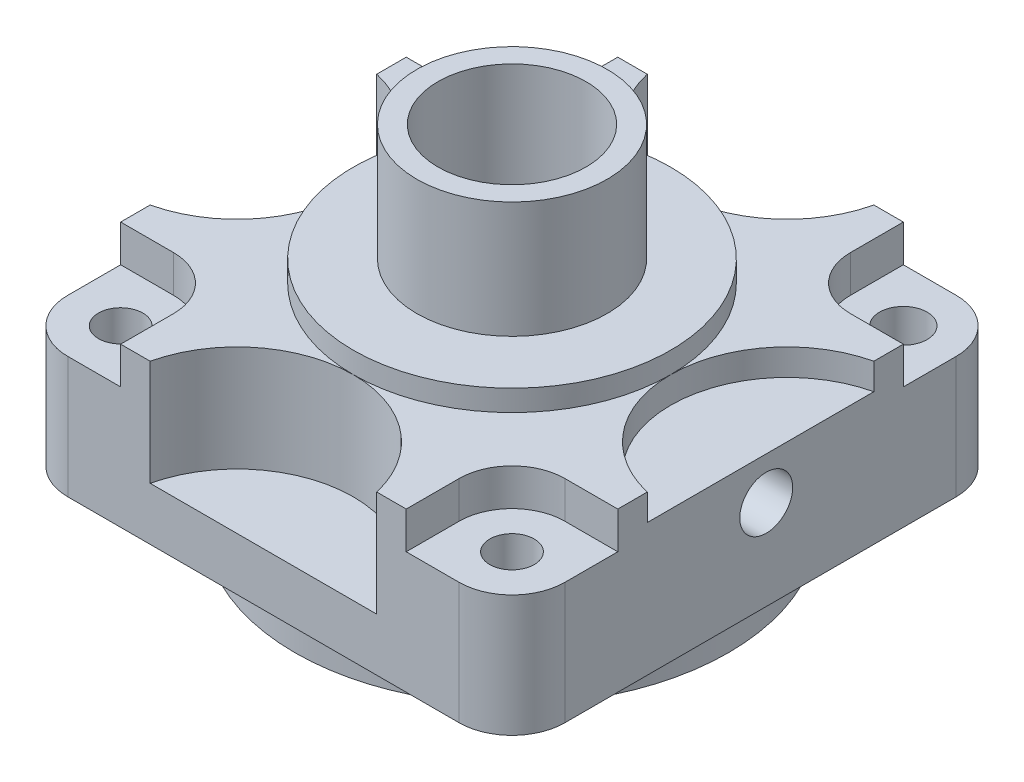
from build123d import *

# Parameters (mm, degrees)
ESQUISSE1_W                     = 47
ESQUISSE1_H                     = 15
EXTRUSION1_DEPTH                = 47
ESQUISSE2_R                     = 20.5
EXTRUSION2_DEPTH                = 5
ESQUISSE3_R                     = 9.75
EXTRUSION3_DEPTH                = 3.5
ESQUISSE4_R                     = 15
EXTRUSION4_DEPTH                = 2
ESQUISSE5_R                     = 9
EXTRUSION5_DEPTH                = 11
ESQUISSE6_R                     = 7
ENL_V_MAT_EXTRU_1_DEPTH         = 13
ESQUISSE7_R                     = 5.75
ENL_V_MAT_EXTRU_2_DEPTH         = 58.563008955
ESQUISSE8_R                     = 8.25
ENL_V_MAT_EXTRU_3_DEPTH         = 17
ENL_V_MAT_EXTRU_4_DEPTH         = 10
ENL_V_MAT_EXTRU_5_DEPTH         = 2.5
CONG_1_R                        = 5
TROU_TARAUD_M63_D               = 5
TROU_TARAUD_M63_DEPTH           = 11
TROU_TARAUD_M63_TIP             = 1.502151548
TROU_TARAUD_M63_ON_FACE_2_D     = 5
TROU_TARAUD_M63_ON_FACE_2_DEPTH = 11
TROU_TARAUD_M63_ON_FACE_2_TIP   = 1.502151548
ESQUISSE12_R                    = 2.25
ESQUISSE12_R_2                  = 2.1
ENL_V_MAT_EXTRU_6_DEPTH         = 58.563008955
EXTRUSION11_DEPTH               = 3.5


with BuildPart() as part:
    # Esquisse1 → Extrusion1 (new body)
    with BuildSketch(Plane.XY):
        with Locations((0, 7.5)):
            Rectangle(ESQUISSE1_W, ESQUISSE1_H)
    extrude(amount=EXTRUSION1_DEPTH)

    # Esquisse2 → Extrusion2 (add)
    with BuildSketch(Plane.XZ):
        with Locations(Location((0, 23.528493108, 0), (0, 0, 90))):
            Circle(ESQUISSE2_R)
    extrude(amount=EXTRUSION2_DEPTH)

    # Esquisse3 → Extrusion3 (add)
    with BuildSketch(Plane.XZ.offset(5)):
        with Locations((0, 23.528493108)):
            Circle(ESQUISSE3_R)
    extrude(amount=EXTRUSION3_DEPTH)

    # Esquisse4 → Extrusion4 (add)
    with BuildSketch(Plane(origin=(0, 15, 0), x_dir=(-1, 0, 0), z_dir=(0, 1, 0))):
        with Locations(Location((0, 23.5, 0), (0, 0, 270))):
            Circle(ESQUISSE4_R)
    extrude(amount=EXTRUSION4_DEPTH)

    # Esquisse5 → Extrusion5 (add)
    with BuildSketch(Plane(origin=(0, 17, 0), x_dir=(-1, 0, 0), z_dir=(0, 1, 0))):
        with Locations(Location((0, 23.5, 0), (0, 0, 90))):
            Circle(ESQUISSE5_R)
    extrude(amount=EXTRUSION5_DEPTH)

    # Esquisse6 → Enl_v. mat.-Extru.1 (cut)
    with BuildSketch(Plane(origin=(0, 28, 0), x_dir=(-1, 0, 0), z_dir=(0, 1, 0))):
        with Locations(Location((0, 23.5, 0), (0, 0, 90))):
            Circle(ESQUISSE6_R)
    extrude(amount=-ENL_V_MAT_EXTRU_1_DEPTH, mode=Mode.SUBTRACT)

    # Esquisse7 → Enl_v. mat.-Extru.2 (cut, through all)
    with BuildSketch(Plane(origin=(0, 15, 0), x_dir=(-1, 0, 0), z_dir=(0, 1, 0))):
        with Locations(Location((0, 23.5, 0), (0, 0, 90))):
            Circle(ESQUISSE7_R)
    extrude(amount=-ENL_V_MAT_EXTRU_2_DEPTH, mode=Mode.SUBTRACT)

    # Esquisse8 → Enl_v. mat.-Extru.3 (cut)
    with BuildSketch(Plane.XZ.offset(8.5)):
        with Locations((0, 23.528493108)):
            Circle(ESQUISSE8_R)
    extrude(amount=-ENL_V_MAT_EXTRU_3_DEPTH, mode=Mode.SUBTRACT)

    # Esquisse9 → Enl_v. mat.-Extru.4 (cut)
    with BuildSketch(Plane(origin=(0, 15, 0), x_dir=(-1, 0, 0), z_dir=(0, 1, 0))):
        with BuildLine():
            Line((-10.712142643, 0), (10.712142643, 0))
            ThreePointArc((10.712142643, 0), (0, 8.5), (-10.712142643, 0))
        make_face()
        with BuildLine():
            Line((-10.712142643, 47), (10.712142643, 47))
            ThreePointArc((10.712142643, 47), (0, 38.5), (-10.712142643, 47))
        make_face()
        with BuildLine():
            Line((23.5, 12.787857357), (23.5, 34.212142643))
            ThreePointArc((23.5, 34.212142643), (15, 23.5), (23.5, 12.787857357))
        make_face()
    extrude(amount=-ENL_V_MAT_EXTRU_4_DEPTH, mode=Mode.SUBTRACT)

    # Esquisse10 → Enl_v. mat.-Extru.5 (cut)
    with BuildSketch(Plane(origin=(0, 15, 0), x_dir=(-1, 0, 0), z_dir=(0, 1, 0))):
        with BuildLine():
            Line((-23.5, 12.787857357), (-23.5, 34.212142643))
            ThreePointArc((-23.5, 34.212142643), (-15, 23.5), (-23.5, 12.787857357))
        make_face()
    extrude(amount=-ENL_V_MAT_EXTRU_5_DEPTH, mode=Mode.SUBTRACT)

    # Cong_1
    cong_1_edges = [part.edges().sort_by_distance(p)[0] for p in [
        (23.5, 7.5, 47),
        (-23.5, 7.5, 47),
        (23.5, 7.5, 0),
        (-23.5, 7.5, 0),
    ]]
    fillet(cong_1_edges, radius=CONG_1_R)

    # Trou taraud_ M63
    with Locations(Plane(origin=(23.5, 8.5, 22.961925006), x_dir=(0, 1, 0), z_dir=(1, 0, 0))):
        with Locations((0, 0)):
            Hole(TROU_TARAUD_M63_D / 2, depth=TROU_TARAUD_M63_DEPTH)
            with Locations((0, 0, -(TROU_TARAUD_M63_DEPTH + TROU_TARAUD_M63_TIP / 2))):  # 118° drill point
                Cone(0, TROU_TARAUD_M63_D / 2, TROU_TARAUD_M63_TIP, mode=Mode.SUBTRACT)

    # Trou taraud_ M63 on face 2
    with Locations(Plane(origin=(0, -12.364018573, -29.415216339), x_dir=(0, 1, 0), z_dir=(1, 0, 0))):
        with Locations((0, 0)):
            Hole(TROU_TARAUD_M63_ON_FACE_2_D / 2, depth=TROU_TARAUD_M63_ON_FACE_2_DEPTH)
            with Locations((0, 0, -(TROU_TARAUD_M63_ON_FACE_2_DEPTH + TROU_TARAUD_M63_ON_FACE_2_TIP / 2))):  # 118° drill point
                Cone(0, TROU_TARAUD_M63_ON_FACE_2_D / 2, TROU_TARAUD_M63_ON_FACE_2_TIP, mode=Mode.SUBTRACT)

    # Esquisse12 → Enl_v. mat.-Extru.6 (cut, through all)
    with BuildSketch(Plane(origin=(0, 15, 0), x_dir=(-1, 0, 0), z_dir=(0, 1, 0))):
        with Locations(Location((-18.5, 5, 0), (0, 0, 90))):
            Circle(ESQUISSE12_R)
        with Locations(Location((-18.5, 42, 0), (0, 0, 90))):
            Circle(ESQUISSE12_R_2)
        with Locations(Location((18.5, 42, 0), (0, 0, 90))):
            Circle(ESQUISSE12_R_2)
        with Locations(Location((18.5, 5, 0), (0, 0, 90))):
            Circle(ESQUISSE12_R_2)
    extrude(amount=-ENL_V_MAT_EXTRU_6_DEPTH, mode=Mode.SUBTRACT)

    # Esquisse13 → Extrusion11 (cut)
    with BuildSketch(Plane(origin=(0, 15, 0), x_dir=(1, 0, 0), z_dir=(0, 1, 0))):
        with BuildLine():
            Line((13.5, -42), (13.5, -47))
            Line((13.5, -47), (18.5, -47))
            ThreePointArc((18.5, -47), (22.035533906, -45.535533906), (23.5, -42))
            Line((23.5, -42), (23.5, -37))
            Line((23.5, -37), (18.5, -37))
            ThreePointArc((18.5, -37), (14.964466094, -38.464466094), (13.5, -42))
        make_face()
        with BuildLine():
            Line((18.5, -10), (23.5, -10))
            Line((23.5, -10), (23.5, -5))
            ThreePointArc((23.5, -5), (22.035533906, -1.464466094), (18.5, 0))
            Line((18.5, 0), (13.5, 0))
            Line((13.5, 0), (13.5, -5))
            ThreePointArc((13.5, -5), (14.964466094, -8.535533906), (18.5, -10))
        make_face()
        with BuildLine():
            Line((-13.5, -5), (-13.5, 0))
            Line((-13.5, 0), (-18.5, 0))
            ThreePointArc((-18.5, 0), (-22.035533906, -1.464466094), (-23.5, -5))
            Line((-23.5, -5), (-23.5, -10))
            Line((-23.5, -10), (-18.5, -10))
            ThreePointArc((-18.5, -10), (-14.964466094, -8.535533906), (-13.5, -5))
        make_face()
        with BuildLine():
            Line((-13.5, -42), (-13.5, -47))
            Line((-13.5, -47), (-18.5, -47))
            ThreePointArc((-18.5, -47), (-22.035533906, -45.535533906), (-23.5, -42))
            Line((-23.5, -42), (-23.5, -37))
            Line((-23.5, -37), (-18.5, -37))
            ThreePointArc((-18.5, -37), (-14.964466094, -38.464466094), (-13.5, -42))
        make_face()
    extrude(amount=-EXTRUSION11_DEPTH, mode=Mode.SUBTRACT)


solid = part.part
